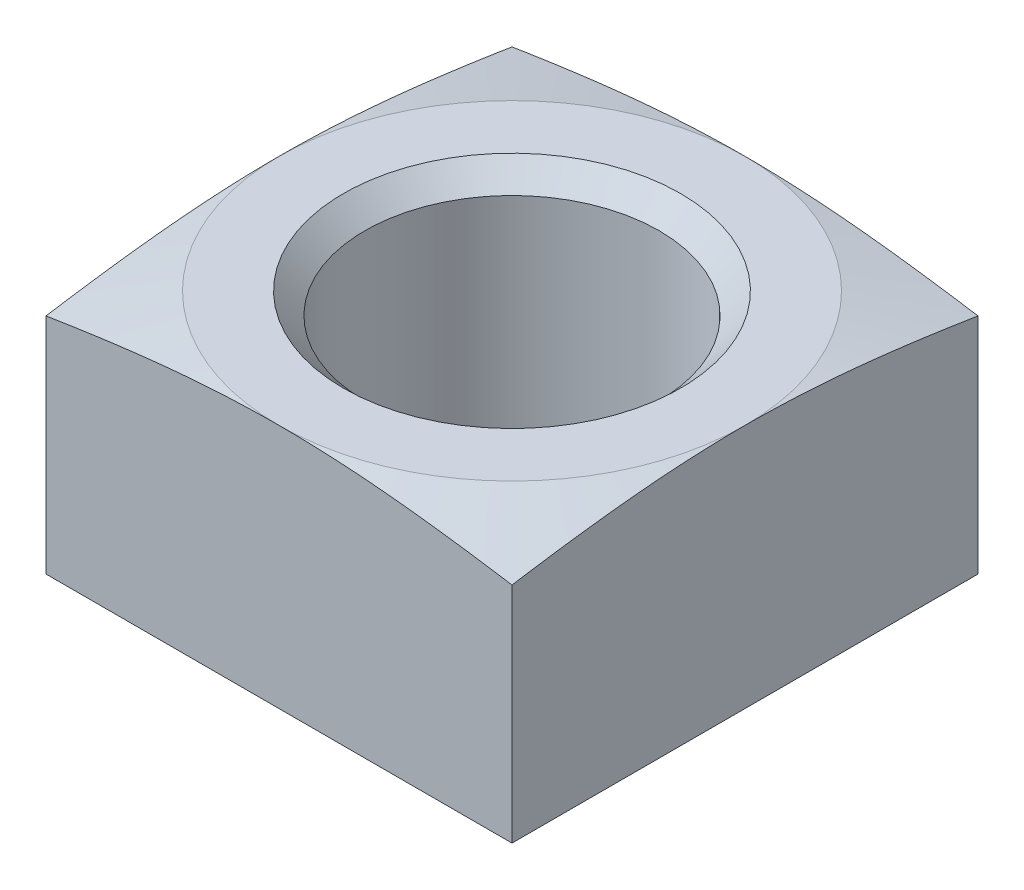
ISO-10303-21;
HEADER;
FILE_DESCRIPTION(('STEP AP214'),'2;1');
FILE_NAME('part.step','',(''),(''),'','','');
FILE_SCHEMA(('AUTOMOTIVE_DESIGN { 1 0 10303 214 1 1 1 1 }'));
ENDSEC;
DATA;
#1=APPLICATION_CONTEXT('core data for automotive mechanical design processes');
#2=APPLICATION_PROTOCOL_DEFINITION('international standard','automotive_design',2000,#1);
#3=PRODUCT_CONTEXT('',#1,'mechanical');
#4=PRODUCT('Part','Part','',(#3));
#5=PRODUCT_RELATED_PRODUCT_CATEGORY('part','',(#4));
#6=PRODUCT_DEFINITION_FORMATION('','',#4);
#7=PRODUCT_DEFINITION_CONTEXT('part definition',#1,'design');
#8=PRODUCT_DEFINITION('design','',#6,#7);
#9=PRODUCT_DEFINITION_SHAPE('','',#8);
#10=(LENGTH_UNIT() NAMED_UNIT(*) SI_UNIT(.MILLI.,.METRE.));
#11=(NAMED_UNIT(*) PLANE_ANGLE_UNIT() SI_UNIT($,.RADIAN.));
#12=(NAMED_UNIT(*) SI_UNIT($,.STERADIAN.) SOLID_ANGLE_UNIT());
#13=UNCERTAINTY_MEASURE_WITH_UNIT(LENGTH_MEASURE(1.E-05),#10,'distance_accuracy_value','');
#14=(GEOMETRIC_REPRESENTATION_CONTEXT(3) GLOBAL_UNCERTAINTY_ASSIGNED_CONTEXT((#13)) GLOBAL_UNIT_ASSIGNED_CONTEXT((#10,
#11,#12)) REPRESENTATION_CONTEXT('',''));
#15=CARTESIAN_POINT('',(0.,0.,0.));
#16=DIRECTION('',(0.,0.,1.));
#17=DIRECTION('',(1.,0.,0.));
#18=AXIS2_PLACEMENT_3D('',#15,#16,#17);
#19=CARTESIAN_POINT('',(9.5,5.,9.5));
#20=DIRECTION('',(0.,0.,-1.));
#21=DIRECTION('',(0.,1.,0.));
#22=AXIS2_PLACEMENT_3D('',#19,#20,#21);
#23=PLANE('',#22);
#24=DIRECTION('',(0.,-1.,0.));
#25=VECTOR('',#24,1.);
#26=CARTESIAN_POINT('',(9.5,5.,9.5));
#27=LINE('',#26,#25);
#28=CARTESIAN_POINT('',(9.5,4.11461851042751,9.5));
#29=VERTEX_POINT('',#28);
#30=CARTESIAN_POINT('',(9.5,-5.,9.5));
#31=VERTEX_POINT('',#30);
#32=EDGE_CURVE('E122',#29,#31,#27,.T.);
#33=ORIENTED_EDGE('',*,*,#32,.F.);
#34=CARTESIAN_POINT('',(-18.9541826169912,2.36712304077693,9.5));
#35=CARTESIAN_POINT('',(-18.4619993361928,2.46610878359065,9.5));
#36=CARTESIAN_POINT('',(-17.9696709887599,2.56438082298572,9.5));
#37=CARTESIAN_POINT('',(-16.9846499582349,2.75911201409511,9.5));
#38=CARTESIAN_POINT('',(-16.4919572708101,2.85557114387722,9.5));
#39=CARTESIAN_POINT('',(-15.5062030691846,3.04627743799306,9.5));
#40=CARTESIAN_POINT('',(-15.0131416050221,3.14052486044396,9.5));
#41=CARTESIAN_POINT('',(-14.026504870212,3.32629087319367,9.5));
#42=CARTESIAN_POINT('',(-13.532929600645,3.41780946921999,9.5));
#43=CARTESIAN_POINT('',(-12.5469696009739,3.59710907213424,9.5));
#44=CARTESIAN_POINT('',(-12.0545871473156,3.68490256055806,9.5));
#45=CARTESIAN_POINT('',(-11.0690776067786,3.85622719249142,9.5));
#46=CARTESIAN_POINT('',(-10.5759505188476,3.9397583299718,9.5));
#47=CARTESIAN_POINT('',(-9.58861387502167,4.10144355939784,9.5));
#48=CARTESIAN_POINT('',(-9.09440397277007,4.17959554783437,9.5));
#49=CARTESIAN_POINT('',(-8.10493292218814,4.32900434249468,9.5));
#50=CARTESIAN_POINT('',(-7.60967176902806,4.40026111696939,9.5));
#51=CARTESIAN_POINT('',(-6.61365000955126,4.53458833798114,9.5));
#52=CARTESIAN_POINT('',(-6.11287898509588,4.59758234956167,9.5));
#53=CARTESIAN_POINT('',(-5.1100339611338,4.71233609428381,9.5));
#54=CARTESIAN_POINT('',(-4.60795996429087,4.76409585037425,9.5));
#55=CARTESIAN_POINT('',(-3.60299016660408,4.85378622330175,9.5));
#56=CARTESIAN_POINT('',(-3.10009544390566,4.89172869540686,9.5));
#57=CARTESIAN_POINT('',(-2.09333858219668,4.95144660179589,9.5));
#58=CARTESIAN_POINT('',(-1.58947647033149,4.97322248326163,9.5));
#59=CARTESIAN_POINT('',(-0.579875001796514,4.99900276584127,9.5));
#60=CARTESIAN_POINT('',(-0.0741343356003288,5.00295730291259,9.5));
#61=CARTESIAN_POINT('',(0.93715695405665,4.99263492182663,9.5));
#62=CARTESIAN_POINT('',(1.44270757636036,4.9783578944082,9.5));
#63=CARTESIAN_POINT('',(2.45342480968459,4.93268693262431,9.5));
#64=CARTESIAN_POINT('',(2.95859079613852,4.90127940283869,9.5));
#65=CARTESIAN_POINT('',(3.71544565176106,4.84296152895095,9.5));
#66=CARTESIAN_POINT('',(3.96758477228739,4.82165413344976,9.5));
#67=CARTESIAN_POINT('',(4.4715511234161,4.77562338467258,9.5));
#68=CARTESIAN_POINT('',(4.72337835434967,4.75090003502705,9.5));
#69=CARTESIAN_POINT('',(5.69012353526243,4.64999687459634,9.5));
#70=CARTESIAN_POINT('',(6.40390887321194,4.5628945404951,9.5));
#71=CARTESIAN_POINT('',(7.8290621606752,4.37065349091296,9.5));
#72=CARTESIAN_POINT('',(8.54042977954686,4.2655124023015,9.5));
#73=CARTESIAN_POINT('',(9.96145638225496,4.04244775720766,9.5));
#74=CARTESIAN_POINT('',(10.6711144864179,3.9245186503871,9.5));
#75=CARTESIAN_POINT('',(12.0888212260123,3.67964048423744,9.5));
#76=CARTESIAN_POINT('',(12.7968699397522,3.55269187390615,9.5));
#77=CARTESIAN_POINT('',(14.2128800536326,3.29210564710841,9.5));
#78=CARTESIAN_POINT('',(14.9208395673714,3.1584578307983,9.5));
#79=CARTESIAN_POINT('',(16.3358462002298,2.88639891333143,9.5));
#80=CARTESIAN_POINT('',(17.0428933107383,2.74798776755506,9.5));
#81=CARTESIAN_POINT('',(18.456096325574,2.4676441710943,9.5));
#82=CARTESIAN_POINT('',(19.1622524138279,2.32571264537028,9.5));
#83=CARTESIAN_POINT('',(20.5740111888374,2.03914033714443,9.5));
#84=CARTESIAN_POINT('',(21.2796138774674,1.89449956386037,9.5));
#85=CARTESIAN_POINT('',(22.6870918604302,1.60379615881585,9.5));
#86=CARTESIAN_POINT('',(23.3889691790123,1.45774331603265,9.5));
#87=CARTESIAN_POINT('',(24.7923789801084,1.16398924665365,9.5));
#88=CARTESIAN_POINT('',(25.4939114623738,1.01628801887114,9.5));
#89=CARTESIAN_POINT('',(27.5982051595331,0.571197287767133,9.5));
#90=CARTESIAN_POINT('',(29.000550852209,0.271843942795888,9.5));
#91=CARTESIAN_POINT('',(31.7997634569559,-0.329323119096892,9.5));
#92=CARTESIAN_POINT('',(33.1966328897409,-0.631125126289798,9.5));
#93=CARTESIAN_POINT('',(35.2914790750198,-1.08564081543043,9.5));
#94=CARTESIAN_POINT('',(35.9896541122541,-1.23744144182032,9.5));
#95=CARTESIAN_POINT('',(37.3858901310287,-1.54156486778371,9.5));
#96=CARTESIAN_POINT('',(38.0839511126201,-1.69388766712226,9.5));
#97=CARTESIAN_POINT('',(38.781964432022,-1.8464284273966,9.5));
#98=B_SPLINE_CURVE_WITH_KNOTS('',3,(#34,#35,#36,#37,#38,#39,#40,#41,#42,#43,#44,#45,#46,#47,#48,
#49,#50,#51,#52,#53,#54,#55,#56,#57,#58,#59,#60,#61,#62,#63,#64,#65,#66,#67,#68,#69,#70,#71,#72,
#73,#74,#75,#76,#77,#78,#79,#80,#81,#82,#83,#84,#85,#86,#87,#88,#89,#90,#91,#92,#93,#94,#95,#96,
#97),.UNSPECIFIED.,.F.,.F.,(4,2,2,2,2,2,2,2,2,2,2,2,2,2,2,2,2,2,2,2,2,2,2,2,2,2,2,2,2,2,2,4),
(0.,1.50611692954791,3.01225206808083,4.51821055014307,6.0241658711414,7.52459569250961,
9.02502763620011,10.5260430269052,12.027065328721,13.5411179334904,15.0551674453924,
16.5679148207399,18.0806203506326,19.5975558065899,21.1145003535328,22.6326505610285,
23.391744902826,24.1508384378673,26.3077001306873,28.4648457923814,30.622931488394,
32.7809098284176,34.9422799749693,37.1036703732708,39.2644987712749,41.4253198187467,
43.5760541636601,45.7267900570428,50.0286043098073,54.3159036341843,56.4593647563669,
58.6028249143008),.UNSPECIFIED.);
#99=CARTESIAN_POINT('',(0.,5.,9.5));
#100=VERTEX_POINT('',#99);
#101=EDGE_CURVE('E99',#29,#100,#98,.F.);
#102=ORIENTED_EDGE('',*,*,#101,.T.);
#103=CARTESIAN_POINT('',(-9.5,4.11461851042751,9.5));
#104=VERTEX_POINT('',#103);
#105=EDGE_CURVE('E112',#100,#104,#98,.F.);
#106=ORIENTED_EDGE('',*,*,#105,.T.);
#107=DIRECTION('',(0.,-1.,0.));
#108=VECTOR('',#107,1.);
#109=CARTESIAN_POINT('',(-9.5,5.,9.5));
#110=LINE('',#109,#108);
#111=CARTESIAN_POINT('',(-9.5,-5.,9.5));
#112=VERTEX_POINT('',#111);
#113=EDGE_CURVE('E184',#104,#112,#110,.T.);
#114=ORIENTED_EDGE('',*,*,#113,.T.);
#115=DIRECTION('',(-1.,0.,0.));
#116=VECTOR('',#115,1.);
#117=CARTESIAN_POINT('',(9.5,-5.,9.5));
#118=LINE('',#117,#116);
#119=EDGE_CURVE('E193',#31,#112,#118,.T.);
#120=ORIENTED_EDGE('',*,*,#119,.F.);
#121=EDGE_LOOP('',(#33,#102,#106,#114,#120));
#122=FACE_BOUND('',#121,.T.);
#123=ADVANCED_FACE('F39',(#122),#23,.F.);
#124=CARTESIAN_POINT('',(9.5,-5.,-9.5));
#125=DIRECTION('',(0.,1.,0.));
#126=DIRECTION('',(0.,0.,1.));
#127=AXIS2_PLACEMENT_3D('',#124,#125,#126);
#128=PLANE('',#127);
#129=CARTESIAN_POINT('',(0.,-5.,0.));
#130=DIRECTION('',(0.,1.,0.));
#131=DIRECTION('',(0.,0.,1.));
#132=AXIS2_PLACEMENT_3D('',#129,#130,#131);
#133=CIRCLE('',#132,6.87500000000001);
#134=CARTESIAN_POINT('',(0.,-5.,6.87500000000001));
#135=VERTEX_POINT('',#134);
#136=EDGE_CURVE('E11',#135,#135,#133,.T.);
#137=ORIENTED_EDGE('',*,*,#136,.T.);
#138=EDGE_LOOP('',(#137));
#139=FACE_BOUND('',#138,.T.);
#140=DIRECTION('',(0.,0.,-1.));
#141=VECTOR('',#140,1.);
#142=CARTESIAN_POINT('',(-9.5,-5.,-9.5));
#143=LINE('',#142,#141);
#144=CARTESIAN_POINT('',(-9.5,-5.,-9.5));
#145=VERTEX_POINT('',#144);
#146=EDGE_CURVE('E187',#112,#145,#143,.T.);
#147=ORIENTED_EDGE('',*,*,#146,.T.);
#148=DIRECTION('',(-1.,0.,0.));
#149=VECTOR('',#148,1.);
#150=CARTESIAN_POINT('',(9.5,-5.,-9.5));
#151=LINE('',#150,#149);
#152=CARTESIAN_POINT('',(9.5,-5.,-9.5));
#153=VERTEX_POINT('',#152);
#154=EDGE_CURVE('E183',#153,#145,#151,.T.);
#155=ORIENTED_EDGE('',*,*,#154,.F.);
#156=DIRECTION('',(0.,0.,-1.));
#157=VECTOR('',#156,1.);
#158=CARTESIAN_POINT('',(9.5,-5.,-9.5));
#159=LINE('',#158,#157);
#160=EDGE_CURVE('E175',#31,#153,#159,.T.);
#161=ORIENTED_EDGE('',*,*,#160,.F.);
#162=ORIENTED_EDGE('',*,*,#119,.T.);
#163=EDGE_LOOP('',(#147,#155,#161,#162));
#164=FACE_BOUND('',#163,.T.);
#165=ADVANCED_FACE('F224',(#139,#164),#128,.F.);
#166=CARTESIAN_POINT('',(9.5,5.,-9.5));
#167=DIRECTION('',(0.,0.,1.));
#168=DIRECTION('',(0.,-1.,0.));
#169=AXIS2_PLACEMENT_3D('',#166,#167,#168);
#170=PLANE('',#169);
#171=DIRECTION('',(0.,1.,0.));
#172=VECTOR('',#171,1.);
#173=CARTESIAN_POINT('',(-9.5,5.,-9.5));
#174=LINE('',#173,#172);
#175=CARTESIAN_POINT('',(-9.5,4.11461851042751,-9.5));
#176=VERTEX_POINT('',#175);
#177=EDGE_CURVE('E176',#145,#176,#174,.T.);
#178=ORIENTED_EDGE('',*,*,#177,.T.);
#179=CARTESIAN_POINT('',(-18.9541826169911,2.36712304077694,-9.5));
#180=CARTESIAN_POINT('',(-18.4619993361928,2.46610878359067,-9.5));
#181=CARTESIAN_POINT('',(-17.9696709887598,2.56438082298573,-9.5));
#182=CARTESIAN_POINT('',(-16.9846499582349,2.75911201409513,-9.5));
#183=CARTESIAN_POINT('',(-16.4919572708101,2.85557114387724,-9.5));
#184=CARTESIAN_POINT('',(-15.5062030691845,3.04627743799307,-9.5));
#185=CARTESIAN_POINT('',(-15.0131416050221,3.14052486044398,-9.5));
#186=CARTESIAN_POINT('',(-14.0265048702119,3.32629087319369,-9.5));
#187=CARTESIAN_POINT('',(-13.5329296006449,3.41780946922,-9.5));
#188=CARTESIAN_POINT('',(-12.5469696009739,3.59710907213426,-9.5));
#189=CARTESIAN_POINT('',(-12.0545871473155,3.68490256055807,-9.5));
#190=CARTESIAN_POINT('',(-11.0690776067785,3.85622719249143,-9.5));
#191=CARTESIAN_POINT('',(-10.5759505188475,3.93975832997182,-9.5));
#192=CARTESIAN_POINT('',(-9.58861387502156,4.10144355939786,-9.5));
#193=CARTESIAN_POINT('',(-9.09440397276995,4.17959554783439,-9.5));
#194=CARTESIAN_POINT('',(-8.10493292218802,4.3290043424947,-9.5));
#195=CARTESIAN_POINT('',(-7.60967176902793,4.40026111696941,-9.5));
#196=CARTESIAN_POINT('',(-6.61365000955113,4.53458833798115,-9.5));
#197=CARTESIAN_POINT('',(-6.11287898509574,4.59758234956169,-9.5));
#198=CARTESIAN_POINT('',(-5.11003396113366,4.71233609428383,-9.5));
#199=CARTESIAN_POINT('',(-4.60795996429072,4.76409585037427,-9.5));
#200=CARTESIAN_POINT('',(-3.60299016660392,4.85378622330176,-9.5));
#201=CARTESIAN_POINT('',(-3.10009544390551,4.89172869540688,-9.5));
#202=CARTESIAN_POINT('',(-2.09333858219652,4.9514466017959,-9.5));
#203=CARTESIAN_POINT('',(-1.58947647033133,4.97322248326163,-9.5));
#204=CARTESIAN_POINT('',(-0.579875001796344,4.99900276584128,-9.5));
#205=CARTESIAN_POINT('',(-0.0741343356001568,5.00295730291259,-9.5));
#206=CARTESIAN_POINT('',(0.937156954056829,4.99263492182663,-9.5));
#207=CARTESIAN_POINT('',(1.44270757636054,4.9783578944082,-9.5));
#208=CARTESIAN_POINT('',(2.45342480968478,4.93268693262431,-9.5));
#209=CARTESIAN_POINT('',(2.95859079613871,4.90127940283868,-9.5));
#210=CARTESIAN_POINT('',(3.71544565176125,4.84296152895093,-9.5));
#211=CARTESIAN_POINT('',(3.96758477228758,4.82165413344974,-9.5));
#212=CARTESIAN_POINT('',(4.4715511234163,4.77562338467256,-9.5));
#213=CARTESIAN_POINT('',(4.72337835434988,4.75090003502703,-9.5));
#214=CARTESIAN_POINT('',(5.69012353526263,4.64999687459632,-9.5));
#215=CARTESIAN_POINT('',(6.40390887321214,4.56289454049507,-9.5));
#216=CARTESIAN_POINT('',(7.82906216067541,4.37065349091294,-9.5));
#217=CARTESIAN_POINT('',(8.54042977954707,4.26551240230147,-9.5));
#218=CARTESIAN_POINT('',(9.96145638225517,4.04244775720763,-9.5));
#219=CARTESIAN_POINT('',(10.6711144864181,3.92451865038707,-9.5));
#220=CARTESIAN_POINT('',(12.0888212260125,3.67964048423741,-9.5));
#221=CARTESIAN_POINT('',(12.7968699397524,3.55269187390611,-9.5));
#222=CARTESIAN_POINT('',(14.2128800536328,3.29210564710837,-9.5));
#223=CARTESIAN_POINT('',(14.9208395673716,3.15845783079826,-9.5));
#224=CARTESIAN_POINT('',(16.33584620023,2.88639891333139,-9.5));
#225=CARTESIAN_POINT('',(17.0428933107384,2.74798776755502,-9.5));
#226=CARTESIAN_POINT('',(18.4560963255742,2.46764417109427,-9.5));
#227=CARTESIAN_POINT('',(19.1622524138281,2.32571264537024,-9.5));
#228=CARTESIAN_POINT('',(20.5740111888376,2.03914033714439,-9.5));
#229=CARTESIAN_POINT('',(21.2796138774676,1.89449956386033,-9.5));
#230=CARTESIAN_POINT('',(22.6870918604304,1.60379615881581,-9.5));
#231=CARTESIAN_POINT('',(23.3889691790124,1.45774331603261,-9.5));
#232=CARTESIAN_POINT('',(24.7923789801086,1.16398924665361,-9.5));
#233=CARTESIAN_POINT('',(25.493911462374,1.01628801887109,-9.5));
#234=CARTESIAN_POINT('',(27.5982051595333,0.571197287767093,-9.5));
#235=CARTESIAN_POINT('',(29.0005508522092,0.271843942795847,-9.5));
#236=CARTESIAN_POINT('',(31.7997634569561,-0.329323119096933,-9.5));
#237=CARTESIAN_POINT('',(33.196632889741,-0.631125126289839,-9.5));
#238=CARTESIAN_POINT('',(35.29147907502,-1.08564081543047,-9.5));
#239=CARTESIAN_POINT('',(35.9896541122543,-1.23744144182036,-9.5));
#240=CARTESIAN_POINT('',(37.3858901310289,-1.54156486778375,-9.5));
#241=CARTESIAN_POINT('',(38.0839511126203,-1.6938876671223,-9.5));
#242=CARTESIAN_POINT('',(38.7819644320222,-1.84642842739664,-9.5));
#243=B_SPLINE_CURVE_WITH_KNOTS('',3,(#179,#180,#181,#182,#183,#184,#185,#186,#187,#188,#189,
#190,#191,#192,#193,#194,#195,#196,#197,#198,#199,#200,#201,#202,#203,#204,#205,#206,#207,#208,
#209,#210,#211,#212,#213,#214,#215,#216,#217,#218,#219,#220,#221,#222,#223,#224,#225,#226,#227,
#228,#229,#230,#231,#232,#233,#234,#235,#236,#237,#238,#239,#240,#241,#242),.UNSPECIFIED.,.F.,
.F.,(4,2,2,2,2,2,2,2,2,2,2,2,2,2,2,2,2,2,2,2,2,2,2,2,2,2,2,2,2,2,2,4),(0.,1.50611692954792,
3.01225206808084,4.51821055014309,6.02416587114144,7.52459569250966,9.02502763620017,
10.5260430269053,12.0270653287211,13.5411179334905,15.0551674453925,16.56791482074,
18.0806203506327,19.59755580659,21.114500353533,22.6326505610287,23.3917449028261,
24.1508384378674,26.3077001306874,28.4648457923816,30.6229314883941,32.7809098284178,
34.9422799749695,37.1036703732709,39.264498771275,41.4253198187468,43.5760541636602,
45.7267900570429,50.0286043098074,54.3159036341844,56.459364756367,58.6028249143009),.UNSPECIFIED.);
#244=CARTESIAN_POINT('',(0.,5.,-9.5));
#245=VERTEX_POINT('',#244);
#246=EDGE_CURVE('E62',#176,#245,#243,.T.);
#247=ORIENTED_EDGE('',*,*,#246,.T.);
#248=CARTESIAN_POINT('',(9.5,4.11461851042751,-9.5));
#249=VERTEX_POINT('',#248);
#250=EDGE_CURVE('E137',#245,#249,#243,.T.);
#251=ORIENTED_EDGE('',*,*,#250,.T.);
#252=DIRECTION('',(0.,1.,0.));
#253=VECTOR('',#252,1.);
#254=CARTESIAN_POINT('',(9.5,5.,-9.5));
#255=LINE('',#254,#253);
#256=EDGE_CURVE('E179',#153,#249,#255,.T.);
#257=ORIENTED_EDGE('',*,*,#256,.F.);
#258=ORIENTED_EDGE('',*,*,#154,.T.);
#259=EDGE_LOOP('',(#178,#247,#251,#257,#258));
#260=FACE_BOUND('',#259,.T.);
#261=ADVANCED_FACE('F143',(#260),#170,.F.);
#262=CARTESIAN_POINT('',(9.5,0.,0.));
#263=DIRECTION('',(-1.,0.,0.));
#264=DIRECTION('',(0.,0.,1.));
#265=AXIS2_PLACEMENT_3D('',#262,#263,#264);
#266=PLANE('',#265);
#267=ORIENTED_EDGE('',*,*,#256,.T.);
#268=CARTESIAN_POINT('',(9.5,2.36712304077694,-18.9541826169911));
#269=CARTESIAN_POINT('',(9.5,2.46610878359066,-18.4619993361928));
#270=CARTESIAN_POINT('',(9.5,2.56438082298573,-17.9696709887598));
#271=CARTESIAN_POINT('',(9.5,2.75911201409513,-16.9846499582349));
#272=CARTESIAN_POINT('',(9.5,2.85557114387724,-16.4919572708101));
#273=CARTESIAN_POINT('',(9.5,3.04627743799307,-15.5062030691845));
#274=CARTESIAN_POINT('',(9.5,3.14052486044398,-15.0131416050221));
#275=CARTESIAN_POINT('',(9.5,3.32629087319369,-14.0265048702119));
#276=CARTESIAN_POINT('',(9.5,3.41780946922,-13.5329296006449));
#277=CARTESIAN_POINT('',(9.5,3.59710907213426,-12.5469696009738));
#278=CARTESIAN_POINT('',(9.5,3.68490256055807,-12.0545871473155));
#279=CARTESIAN_POINT('',(9.5,3.85622719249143,-11.0690776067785));
#280=CARTESIAN_POINT('',(9.5,3.93975832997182,-10.5759505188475));
#281=CARTESIAN_POINT('',(9.5,4.10144355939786,-9.58861387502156));
#282=CARTESIAN_POINT('',(9.5,4.17959554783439,-9.09440397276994));
#283=CARTESIAN_POINT('',(9.5,4.3290043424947,-8.10493292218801));
#284=CARTESIAN_POINT('',(9.5,4.40026111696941,-7.60967176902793));
#285=CARTESIAN_POINT('',(9.5,4.53458833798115,-6.61365000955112));
#286=CARTESIAN_POINT('',(9.5,4.59758234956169,-6.11287898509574));
#287=CARTESIAN_POINT('',(9.5,4.71233609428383,-5.11003396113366));
#288=CARTESIAN_POINT('',(9.5,4.76409585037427,-4.60795996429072));
#289=CARTESIAN_POINT('',(9.5,4.85378622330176,-3.60299016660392));
#290=CARTESIAN_POINT('',(9.5,4.89172869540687,-3.10009544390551));
#291=CARTESIAN_POINT('',(9.5,4.9514466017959,-2.09333858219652));
#292=CARTESIAN_POINT('',(9.5,4.97322248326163,-1.58947647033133));
#293=CARTESIAN_POINT('',(9.5,4.99900276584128,-0.579875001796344));
#294=CARTESIAN_POINT('',(9.5,5.00295730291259,-0.0741343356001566));
#295=CARTESIAN_POINT('',(9.5,4.99263492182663,0.937156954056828));
#296=CARTESIAN_POINT('',(9.5,4.9783578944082,1.44270757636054));
#297=CARTESIAN_POINT('',(9.5,4.9326869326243,2.45342480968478));
#298=CARTESIAN_POINT('',(9.5,4.90127940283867,2.95859079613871));
#299=CARTESIAN_POINT('',(9.5,4.84296152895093,3.71544565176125));
#300=CARTESIAN_POINT('',(9.5,4.82165413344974,3.96758477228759));
#301=CARTESIAN_POINT('',(9.5,4.77562338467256,4.4715511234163));
#302=CARTESIAN_POINT('',(9.5,4.75090003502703,4.72337835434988));
#303=CARTESIAN_POINT('',(9.5,4.64999687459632,5.69012353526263));
#304=CARTESIAN_POINT('',(9.5,4.56289454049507,6.40390887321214));
#305=CARTESIAN_POINT('',(9.5,4.37065349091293,7.82906216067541));
#306=CARTESIAN_POINT('',(9.5,4.26551240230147,8.54042977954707));
#307=CARTESIAN_POINT('',(9.5,4.04244775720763,9.96145638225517));
#308=CARTESIAN_POINT('',(9.5,3.92451865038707,10.6711144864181));
#309=CARTESIAN_POINT('',(9.5,3.67964048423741,12.0888212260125));
#310=CARTESIAN_POINT('',(9.5,3.55269187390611,12.7968699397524));
#311=CARTESIAN_POINT('',(9.5,3.29210564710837,14.2128800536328));
#312=CARTESIAN_POINT('',(9.5,3.15845783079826,14.9208395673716));
#313=CARTESIAN_POINT('',(9.5,2.88639891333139,16.33584620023));
#314=CARTESIAN_POINT('',(9.5,2.74798776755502,17.0428933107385));
#315=CARTESIAN_POINT('',(9.5,2.46764417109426,18.4560963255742));
#316=CARTESIAN_POINT('',(9.5,2.32571264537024,19.1622524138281));
#317=CARTESIAN_POINT('',(9.5,2.03914033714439,20.5740111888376));
#318=CARTESIAN_POINT('',(9.5,1.89449956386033,21.2796138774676));
#319=CARTESIAN_POINT('',(9.5,1.60379615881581,22.6870918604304));
#320=CARTESIAN_POINT('',(9.5,1.45774331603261,23.3889691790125));
#321=CARTESIAN_POINT('',(9.5,1.16398924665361,24.7923789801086));
#322=CARTESIAN_POINT('',(9.5,1.01628801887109,25.493911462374));
#323=CARTESIAN_POINT('',(9.5,0.571197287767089,27.5982051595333));
#324=CARTESIAN_POINT('',(9.5,0.271843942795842,29.0005508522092));
#325=CARTESIAN_POINT('',(9.5,-0.329323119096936,31.7997634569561));
#326=CARTESIAN_POINT('',(9.5,-0.63112512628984,33.1966328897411));
#327=CARTESIAN_POINT('',(9.5,-1.08564081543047,35.29147907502));
#328=CARTESIAN_POINT('',(9.5,-1.23744144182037,35.9896541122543));
#329=CARTESIAN_POINT('',(9.5,-1.54156486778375,37.3858901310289));
#330=CARTESIAN_POINT('',(9.5,-1.69388766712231,38.0839511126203));
#331=CARTESIAN_POINT('',(9.5,-1.84642842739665,38.7819644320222));
#332=B_SPLINE_CURVE_WITH_KNOTS('',3,(#268,#269,#270,#271,#272,#273,#274,#275,#276,#277,#278,
#279,#280,#281,#282,#283,#284,#285,#286,#287,#288,#289,#290,#291,#292,#293,#294,#295,#296,#297,
#298,#299,#300,#301,#302,#303,#304,#305,#306,#307,#308,#309,#310,#311,#312,#313,#314,#315,#316,
#317,#318,#319,#320,#321,#322,#323,#324,#325,#326,#327,#328,#329,#330,#331),.UNSPECIFIED.,.F.,
.F.,(4,2,2,2,2,2,2,2,2,2,2,2,2,2,2,2,2,2,2,2,2,2,2,2,2,2,2,2,2,2,2,4),(0.,1.50611692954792,
3.01225206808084,4.5182105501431,6.02416587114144,7.52459569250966,9.02502763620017,
10.5260430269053,12.0270653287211,13.5411179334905,15.0551674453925,16.56791482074,
18.0806203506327,19.59755580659,21.114500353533,22.6326505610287,23.3917449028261,
24.1508384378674,26.3077001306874,28.4648457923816,30.6229314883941,32.7809098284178,
34.9422799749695,37.1036703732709,39.264498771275,41.4253198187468,43.5760541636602,
45.726790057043,50.0286043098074,54.3159036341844,56.4593647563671,58.6028249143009),.UNSPECIFIED.);
#333=CARTESIAN_POINT('',(9.5,5.,0.));
#334=VERTEX_POINT('',#333);
#335=EDGE_CURVE('E172',#249,#334,#332,.T.);
#336=ORIENTED_EDGE('',*,*,#335,.T.);
#337=EDGE_CURVE('E101',#334,#29,#332,.T.);
#338=ORIENTED_EDGE('',*,*,#337,.T.);
#339=ORIENTED_EDGE('',*,*,#32,.T.);
#340=ORIENTED_EDGE('',*,*,#160,.T.);
#341=EDGE_LOOP('',(#267,#336,#338,#339,#340));
#342=FACE_BOUND('',#341,.T.);
#343=ADVANCED_FACE('F155',(#342),#266,.F.);
#344=CARTESIAN_POINT('',(-9.5,0.,0.));
#345=DIRECTION('',(-1.,0.,0.));
#346=DIRECTION('',(0.,0.,1.));
#347=AXIS2_PLACEMENT_3D('',#344,#345,#346);
#348=PLANE('',#347);
#349=CARTESIAN_POINT('',(-9.5,2.36712304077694,-18.9541826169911));
#350=CARTESIAN_POINT('',(-9.5,2.46610878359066,-18.4619993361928));
#351=CARTESIAN_POINT('',(-9.5,2.56438082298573,-17.9696709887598));
#352=CARTESIAN_POINT('',(-9.5,2.75911201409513,-16.9846499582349));
#353=CARTESIAN_POINT('',(-9.5,2.85557114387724,-16.4919572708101));
#354=CARTESIAN_POINT('',(-9.5,3.04627743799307,-15.5062030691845));
#355=CARTESIAN_POINT('',(-9.5,3.14052486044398,-15.0131416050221));
#356=CARTESIAN_POINT('',(-9.5,3.32629087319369,-14.0265048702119));
#357=CARTESIAN_POINT('',(-9.5,3.41780946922,-13.5329296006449));
#358=CARTESIAN_POINT('',(-9.5,3.59710907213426,-12.5469696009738));
#359=CARTESIAN_POINT('',(-9.5,3.68490256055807,-12.0545871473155));
#360=CARTESIAN_POINT('',(-9.5,3.85622719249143,-11.0690776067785));
#361=CARTESIAN_POINT('',(-9.5,3.93975832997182,-10.5759505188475));
#362=CARTESIAN_POINT('',(-9.5,4.10144355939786,-9.58861387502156));
#363=CARTESIAN_POINT('',(-9.5,4.17959554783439,-9.09440397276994));
#364=CARTESIAN_POINT('',(-9.5,4.3290043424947,-8.10493292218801));
#365=CARTESIAN_POINT('',(-9.5,4.40026111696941,-7.60967176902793));
#366=CARTESIAN_POINT('',(-9.5,4.53458833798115,-6.61365000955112));
#367=CARTESIAN_POINT('',(-9.5,4.59758234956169,-6.11287898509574));
#368=CARTESIAN_POINT('',(-9.5,4.71233609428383,-5.11003396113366));
#369=CARTESIAN_POINT('',(-9.5,4.76409585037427,-4.60795996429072));
#370=CARTESIAN_POINT('',(-9.5,4.85378622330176,-3.60299016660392));
#371=CARTESIAN_POINT('',(-9.5,4.89172869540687,-3.10009544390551));
#372=CARTESIAN_POINT('',(-9.5,4.9514466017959,-2.09333858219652));
#373=CARTESIAN_POINT('',(-9.5,4.97322248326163,-1.58947647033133));
#374=CARTESIAN_POINT('',(-9.5,4.99900276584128,-0.579875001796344));
#375=CARTESIAN_POINT('',(-9.5,5.00295730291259,-0.0741343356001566));
#376=CARTESIAN_POINT('',(-9.5,4.99263492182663,0.937156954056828));
#377=CARTESIAN_POINT('',(-9.5,4.9783578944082,1.44270757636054));
#378=CARTESIAN_POINT('',(-9.5,4.9326869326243,2.45342480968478));
#379=CARTESIAN_POINT('',(-9.5,4.90127940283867,2.95859079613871));
#380=CARTESIAN_POINT('',(-9.5,4.84296152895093,3.71544565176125));
#381=CARTESIAN_POINT('',(-9.5,4.82165413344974,3.96758477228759));
#382=CARTESIAN_POINT('',(-9.5,4.77562338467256,4.4715511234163));
#383=CARTESIAN_POINT('',(-9.5,4.75090003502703,4.72337835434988));
#384=CARTESIAN_POINT('',(-9.5,4.64999687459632,5.69012353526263));
#385=CARTESIAN_POINT('',(-9.5,4.56289454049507,6.40390887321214));
#386=CARTESIAN_POINT('',(-9.5,4.37065349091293,7.82906216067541));
#387=CARTESIAN_POINT('',(-9.5,4.26551240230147,8.54042977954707));
#388=CARTESIAN_POINT('',(-9.5,4.04244775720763,9.96145638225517));
#389=CARTESIAN_POINT('',(-9.5,3.92451865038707,10.6711144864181));
#390=CARTESIAN_POINT('',(-9.5,3.67964048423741,12.0888212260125));
#391=CARTESIAN_POINT('',(-9.5,3.55269187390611,12.7968699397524));
#392=CARTESIAN_POINT('',(-9.5,3.29210564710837,14.2128800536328));
#393=CARTESIAN_POINT('',(-9.5,3.15845783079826,14.9208395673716));
#394=CARTESIAN_POINT('',(-9.5,2.88639891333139,16.33584620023));
#395=CARTESIAN_POINT('',(-9.5,2.74798776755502,17.0428933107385));
#396=CARTESIAN_POINT('',(-9.5,2.46764417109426,18.4560963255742));
#397=CARTESIAN_POINT('',(-9.5,2.32571264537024,19.1622524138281));
#398=CARTESIAN_POINT('',(-9.5,2.03914033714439,20.5740111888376));
#399=CARTESIAN_POINT('',(-9.5,1.89449956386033,21.2796138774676));
#400=CARTESIAN_POINT('',(-9.5,1.60379615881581,22.6870918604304));
#401=CARTESIAN_POINT('',(-9.5,1.45774331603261,23.3889691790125));
#402=CARTESIAN_POINT('',(-9.5,1.16398924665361,24.7923789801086));
#403=CARTESIAN_POINT('',(-9.5,1.01628801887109,25.493911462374));
#404=CARTESIAN_POINT('',(-9.5,0.571197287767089,27.5982051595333));
#405=CARTESIAN_POINT('',(-9.5,0.271843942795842,29.0005508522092));
#406=CARTESIAN_POINT('',(-9.5,-0.329323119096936,31.7997634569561));
#407=CARTESIAN_POINT('',(-9.5,-0.63112512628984,33.1966328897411));
#408=CARTESIAN_POINT('',(-9.5,-1.08564081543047,35.29147907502));
#409=CARTESIAN_POINT('',(-9.5,-1.23744144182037,35.9896541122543));
#410=CARTESIAN_POINT('',(-9.5,-1.54156486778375,37.3858901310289));
#411=CARTESIAN_POINT('',(-9.5,-1.69388766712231,38.0839511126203));
#412=CARTESIAN_POINT('',(-9.5,-1.84642842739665,38.7819644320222));
#413=B_SPLINE_CURVE_WITH_KNOTS('',3,(#349,#350,#351,#352,#353,#354,#355,#356,#357,#358,#359,
#360,#361,#362,#363,#364,#365,#366,#367,#368,#369,#370,#371,#372,#373,#374,#375,#376,#377,#378,
#379,#380,#381,#382,#383,#384,#385,#386,#387,#388,#389,#390,#391,#392,#393,#394,#395,#396,#397,
#398,#399,#400,#401,#402,#403,#404,#405,#406,#407,#408,#409,#410,#411,#412),.UNSPECIFIED.,.F.,
.F.,(4,2,2,2,2,2,2,2,2,2,2,2,2,2,2,2,2,2,2,2,2,2,2,2,2,2,2,2,2,2,2,4),(0.,1.50611692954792,
3.01225206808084,4.5182105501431,6.02416587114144,7.52459569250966,9.02502763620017,
10.5260430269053,12.0270653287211,13.5411179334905,15.0551674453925,16.56791482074,
18.0806203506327,19.59755580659,21.114500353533,22.6326505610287,23.3917449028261,
24.1508384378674,26.3077001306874,28.4648457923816,30.6229314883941,32.7809098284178,
34.9422799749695,37.1036703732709,39.264498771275,41.4253198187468,43.5760541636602,
45.726790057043,50.0286043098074,54.3159036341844,56.4593647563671,58.6028249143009),.UNSPECIFIED.);
#414=CARTESIAN_POINT('',(-9.5,5.,0.));
#415=VERTEX_POINT('',#414);
#416=EDGE_CURVE('E55',#176,#415,#413,.T.);
#417=ORIENTED_EDGE('',*,*,#416,.F.);
#418=ORIENTED_EDGE('',*,*,#177,.F.);
#419=ORIENTED_EDGE('',*,*,#146,.F.);
#420=ORIENTED_EDGE('',*,*,#113,.F.);
#421=EDGE_CURVE('E115',#415,#104,#413,.T.);
#422=ORIENTED_EDGE('',*,*,#421,.F.);
#423=EDGE_LOOP('',(#417,#418,#419,#420,#422));
#424=FACE_BOUND('',#423,.T.);
#425=ADVANCED_FACE('F239',(#424),#348,.T.);
#426=CARTESIAN_POINT('',(0.,4.1,0.));
#427=DIRECTION('',(0.,-1.,0.));
#428=DIRECTION('',(0.,0.,-1.));
#429=AXIS2_PLACEMENT_3D('',#426,#427,#428);
#430=CONICAL_SURFACE('',#429,13.5,1.34948188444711);
#431=CARTESIAN_POINT('',(0.,5.,0.));
#432=DIRECTION('',(0.,1.,0.));
#433=DIRECTION('',(0.,0.,1.));
#434=AXIS2_PLACEMENT_3D('',#431,#432,#433);
#435=CIRCLE('',#434,9.5);
#436=EDGE_CURVE('E109',#415,#100,#435,.T.);
#437=ORIENTED_EDGE('',*,*,#436,.F.);
#438=ORIENTED_EDGE('',*,*,#421,.T.);
#439=ORIENTED_EDGE('',*,*,#105,.F.);
#440=EDGE_LOOP('',(#437,#438,#439));
#441=FACE_BOUND('',#440,.T.);
#442=ADVANCED_FACE('F113',(#441),#430,.T.);
#443=ORIENTED_EDGE('',*,*,#416,.T.);
#444=EDGE_CURVE('E126',#245,#415,#435,.T.);
#445=ORIENTED_EDGE('',*,*,#444,.F.);
#446=ORIENTED_EDGE('',*,*,#246,.F.);
#447=EDGE_LOOP('',(#443,#445,#446));
#448=FACE_BOUND('',#447,.T.);
#449=ADVANCED_FACE('F153',(#448),#430,.T.);
#450=EDGE_CURVE('E95',#100,#334,#435,.T.);
#451=ORIENTED_EDGE('',*,*,#450,.F.);
#452=ORIENTED_EDGE('',*,*,#101,.F.);
#453=ORIENTED_EDGE('',*,*,#337,.F.);
#454=EDGE_LOOP('',(#451,#452,#453));
#455=FACE_BOUND('',#454,.T.);
#456=ADVANCED_FACE('F97',(#455),#430,.T.);
#457=EDGE_CURVE('E107',#334,#245,#435,.T.);
#458=ORIENTED_EDGE('',*,*,#457,.F.);
#459=ORIENTED_EDGE('',*,*,#335,.F.);
#460=ORIENTED_EDGE('',*,*,#250,.F.);
#461=EDGE_LOOP('',(#458,#459,#460));
#462=FACE_BOUND('',#461,.T.);
#463=ADVANCED_FACE('F147',(#462),#430,.T.);
#464=CARTESIAN_POINT('',(9.5,5.,-9.5));
#465=DIRECTION('',(0.,-1.,0.));
#466=DIRECTION('',(0.,0.,-1.));
#467=AXIS2_PLACEMENT_3D('',#464,#465,#466);
#468=PLANE('',#467);
#469=CARTESIAN_POINT('',(0.,5.,0.));
#470=DIRECTION('',(0.,-1.,0.));
#471=DIRECTION('',(0.,0.,-1.));
#472=AXIS2_PLACEMENT_3D('',#469,#470,#471);
#473=CIRCLE('',#472,6.875);
#474=CARTESIAN_POINT('',(0.,5.,6.875));
#475=VERTEX_POINT('',#474);
#476=EDGE_CURVE('E48',#475,#475,#473,.T.);
#477=ORIENTED_EDGE('',*,*,#476,.T.);
#478=EDGE_LOOP('',(#477));
#479=FACE_BOUND('',#478,.T.);
#480=ORIENTED_EDGE('',*,*,#457,.T.);
#481=ORIENTED_EDGE('',*,*,#444,.T.);
#482=ORIENTED_EDGE('',*,*,#436,.T.);
#483=ORIENTED_EDGE('',*,*,#450,.T.);
#484=EDGE_LOOP('',(#480,#481,#482,#483));
#485=FACE_BOUND('',#484,.T.);
#486=ADVANCED_FACE('F125',(#479,#485),#468,.F.);
#487=CARTESIAN_POINT('',(0.,-21.9705627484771,0.));
#488=DIRECTION('',(0.,1.,0.));
#489=DIRECTION('',(0.,0.,1.));
#490=AXIS2_PLACEMENT_3D('',#487,#488,#489);
#491=CYLINDRICAL_SURFACE('',#490,6.);
#492=CARTESIAN_POINT('',(0.,4.125,0.));
#493=DIRECTION('',(0.,-1.,0.));
#494=DIRECTION('',(0.,0.,-1.));
#495=AXIS2_PLACEMENT_3D('',#492,#493,#494);
#496=CIRCLE('',#495,6.);
#497=CARTESIAN_POINT('',(0.,4.125,6.));
#498=VERTEX_POINT('',#497);
#499=EDGE_CURVE('E205',#498,#498,#496,.F.);
#500=ORIENTED_EDGE('',*,*,#499,.T.);
#501=EDGE_LOOP('',(#500));
#502=FACE_BOUND('',#501,.T.);
#503=CARTESIAN_POINT('',(0.,-4.12499999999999,0.));
#504=DIRECTION('',(0.,1.,0.));
#505=DIRECTION('',(0.,0.,1.));
#506=AXIS2_PLACEMENT_3D('',#503,#504,#505);
#507=CIRCLE('',#506,6.);
#508=CARTESIAN_POINT('',(0.,-4.12499999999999,6.));
#509=VERTEX_POINT('',#508);
#510=EDGE_CURVE('E202',#509,#509,#507,.F.);
#511=ORIENTED_EDGE('',*,*,#510,.T.);
#512=EDGE_LOOP('',(#511));
#513=FACE_BOUND('',#512,.T.);
#514=ADVANCED_FACE('F154',(#502,#513),#491,.F.);
#515=CARTESIAN_POINT('',(0.,4.125,0.));
#516=DIRECTION('',(0.,1.,0.));
#517=DIRECTION('',(0.,0.,1.));
#518=AXIS2_PLACEMENT_3D('',#515,#516,#517);
#519=CONICAL_SURFACE('',#518,6.,0.78539816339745);
#520=CARTESIAN_POINT('',(0.,5.,6.875));
#521=CARTESIAN_POINT('',(0.,4.99088541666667,6.86588541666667));
#522=CARTESIAN_POINT('',(0.,4.98177083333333,6.85677083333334));
#523=CARTESIAN_POINT('',(0.,4.96354166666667,6.83854166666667));
#524=CARTESIAN_POINT('',(0.,4.95442708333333,6.82942708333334));
#525=CARTESIAN_POINT('',(0.,4.93619791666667,6.81119791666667));
#526=CARTESIAN_POINT('',(0.,4.92708333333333,6.80208333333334));
#527=CARTESIAN_POINT('',(0.,4.90885416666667,6.78385416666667));
#528=CARTESIAN_POINT('',(0.,4.89973958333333,6.77473958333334));
#529=CARTESIAN_POINT('',(0.,4.88151041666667,6.75651041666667));
#530=CARTESIAN_POINT('',(0.,4.87239583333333,6.74739583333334));
#531=CARTESIAN_POINT('',(0.,4.85416666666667,6.72916666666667));
#532=CARTESIAN_POINT('',(0.,4.84505208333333,6.72005208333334));
#533=CARTESIAN_POINT('',(0.,4.82682291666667,6.70182291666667));
#534=CARTESIAN_POINT('',(0.,4.81770833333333,6.69270833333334));
#535=CARTESIAN_POINT('',(0.,4.79947916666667,6.67447916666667));
#536=CARTESIAN_POINT('',(0.,4.79036458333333,6.66536458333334));
#537=CARTESIAN_POINT('',(0.,4.77213541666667,6.64713541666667));
#538=CARTESIAN_POINT('',(0.,4.76302083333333,6.63802083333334));
#539=CARTESIAN_POINT('',(0.,4.74479166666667,6.61979166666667));
#540=CARTESIAN_POINT('',(0.,4.73567708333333,6.61067708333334));
#541=CARTESIAN_POINT('',(0.,4.71744791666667,6.59244791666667));
#542=CARTESIAN_POINT('',(0.,4.70833333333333,6.58333333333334));
#543=CARTESIAN_POINT('',(0.,4.69010416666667,6.56510416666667));
#544=CARTESIAN_POINT('',(0.,4.68098958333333,6.55598958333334));
#545=CARTESIAN_POINT('',(0.,4.66276041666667,6.53776041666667));
#546=CARTESIAN_POINT('',(0.,4.65364583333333,6.52864583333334));
#547=CARTESIAN_POINT('',(0.,4.63541666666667,6.51041666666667));
#548=CARTESIAN_POINT('',(0.,4.62630208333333,6.50130208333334));
#549=CARTESIAN_POINT('',(0.,4.60807291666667,6.48307291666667));
#550=CARTESIAN_POINT('',(0.,4.59895833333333,6.47395833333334));
#551=CARTESIAN_POINT('',(0.,4.58072916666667,6.45572916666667));
#552=CARTESIAN_POINT('',(0.,4.57161458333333,6.44661458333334));
#553=CARTESIAN_POINT('',(0.,4.55338541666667,6.42838541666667));
#554=CARTESIAN_POINT('',(0.,4.54427083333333,6.41927083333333));
#555=CARTESIAN_POINT('',(0.,4.52604166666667,6.40104166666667));
#556=CARTESIAN_POINT('',(0.,4.51692708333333,6.39192708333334));
#557=CARTESIAN_POINT('',(0.,4.49869791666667,6.37369791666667));
#558=CARTESIAN_POINT('',(0.,4.48958333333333,6.36458333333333));
#559=CARTESIAN_POINT('',(0.,4.47135416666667,6.34635416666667));
#560=CARTESIAN_POINT('',(0.,4.46223958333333,6.33723958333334));
#561=CARTESIAN_POINT('',(0.,4.44401041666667,6.31901041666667));
#562=CARTESIAN_POINT('',(0.,4.43489583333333,6.30989583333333));
#563=CARTESIAN_POINT('',(0.,4.41666666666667,6.29166666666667));
#564=CARTESIAN_POINT('',(0.,4.40755208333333,6.28255208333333));
#565=CARTESIAN_POINT('',(0.,4.38932291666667,6.26432291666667));
#566=CARTESIAN_POINT('',(0.,4.38020833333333,6.25520833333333));
#567=CARTESIAN_POINT('',(0.,4.36197916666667,6.23697916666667));
#568=CARTESIAN_POINT('',(0.,4.35286458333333,6.22786458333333));
#569=CARTESIAN_POINT('',(0.,4.33463541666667,6.20963541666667));
#570=CARTESIAN_POINT('',(0.,4.32552083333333,6.20052083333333));
#571=CARTESIAN_POINT('',(0.,4.30729166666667,6.18229166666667));
#572=CARTESIAN_POINT('',(0.,4.29817708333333,6.17317708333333));
#573=CARTESIAN_POINT('',(0.,4.27994791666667,6.15494791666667));
#574=CARTESIAN_POINT('',(0.,4.27083333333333,6.14583333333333));
#575=CARTESIAN_POINT('',(0.,4.25260416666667,6.12760416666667));
#576=CARTESIAN_POINT('',(0.,4.24348958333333,6.11848958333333));
#577=CARTESIAN_POINT('',(0.,4.22526041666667,6.10026041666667));
#578=CARTESIAN_POINT('',(0.,4.21614583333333,6.09114583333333));
#579=CARTESIAN_POINT('',(0.,4.19791666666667,6.07291666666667));
#580=CARTESIAN_POINT('',(0.,4.18880208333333,6.06380208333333));
#581=CARTESIAN_POINT('',(0.,4.17057291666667,6.04557291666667));
#582=CARTESIAN_POINT('',(0.,4.16145833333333,6.03645833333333));
#583=CARTESIAN_POINT('',(0.,4.14322916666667,6.01822916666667));
#584=CARTESIAN_POINT('',(0.,4.13411458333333,6.00911458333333));
#585=CARTESIAN_POINT('',(0.,4.125,6.));
#586=B_SPLINE_CURVE_WITH_KNOTS('',3,(#520,#521,#522,#523,#524,#525,#526,#527,#528,#529,#530,
#531,#532,#533,#534,#535,#536,#537,#538,#539,#540,#541,#542,#543,#544,#545,#546,#547,#548,#549,
#550,#551,#552,#553,#554,#555,#556,#557,#558,#559,#560,#561,#562,#563,#564,#565,#566,#567,#568,
#569,#570,#571,#572,#573,#574,#575,#576,#577,#578,#579,#580,#581,#582,#583,#584,#585),
.UNSPECIFIED.,.F.,.F.,(4,2,2,2,2,2,2,2,2,2,2,2,2,2,2,2,2,2,2,2,2,2,2,2,2,2,2,2,2,2,2,2,4),(0.,
0.0386699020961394,0.0773398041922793,0.116009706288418,0.154679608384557,0.193349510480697,
0.232019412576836,0.270689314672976,0.309359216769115,0.348029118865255,0.386699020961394,
0.425368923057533,0.464038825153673,0.502708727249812,0.541378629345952,0.580048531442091,
0.61871843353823,0.65738833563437,0.696058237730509,0.734728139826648,0.773398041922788,
0.812067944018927,0.850737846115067,0.889407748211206,0.928077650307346,0.966747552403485,
1.00541745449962,1.04408735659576,1.0827572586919,1.12142716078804,1.16009706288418,
1.19876696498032,1.23743686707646),.UNSPECIFIED.);
#587=EDGE_CURVE('BSEAM214',#475,#498,#586,.T.);
#588=ORIENTED_EDGE('',*,*,#476,.F.);
#589=ORIENTED_EDGE('',*,*,#499,.F.);
#590=ORIENTED_EDGE('',*,*,#587,.T.);
#591=ORIENTED_EDGE('',*,*,#587,.F.);
#592=EDGE_LOOP('',(#588,#590,#589,#591));
#593=FACE_BOUND('',#592,.T.);
#594=ADVANCED_FACE('F214',(#593),#519,.F.);
#595=CARTESIAN_POINT('',(0.,-4.12499999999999,0.));
#596=DIRECTION('',(0.,-1.,0.));
#597=DIRECTION('',(0.,0.,-1.));
#598=AXIS2_PLACEMENT_3D('',#595,#596,#597);
#599=CONICAL_SURFACE('',#598,6.,0.785398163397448);
#600=ORIENTED_EDGE('',*,*,#136,.F.);
#601=EDGE_LOOP('',(#600));
#602=FACE_BOUND('',#601,.T.);
#603=ORIENTED_EDGE('',*,*,#510,.F.);
#604=EDGE_LOOP('',(#603));
#605=FACE_BOUND('',#604,.T.);
#606=ADVANCED_FACE('F41',(#602,#605),#599,.F.);
#607=CLOSED_SHELL('',(#123,#165,#261,#343,#425,#442,#449,#456,#463,#486,#514,#594,#606));
#608=MANIFOLD_SOLID_BREP('B2',#607);
#609=ADVANCED_BREP_SHAPE_REPRESENTATION('',(#18,#608),#14);
#610=SHAPE_DEFINITION_REPRESENTATION(#9,#609);
ENDSEC;
END-ISO-10303-21;
